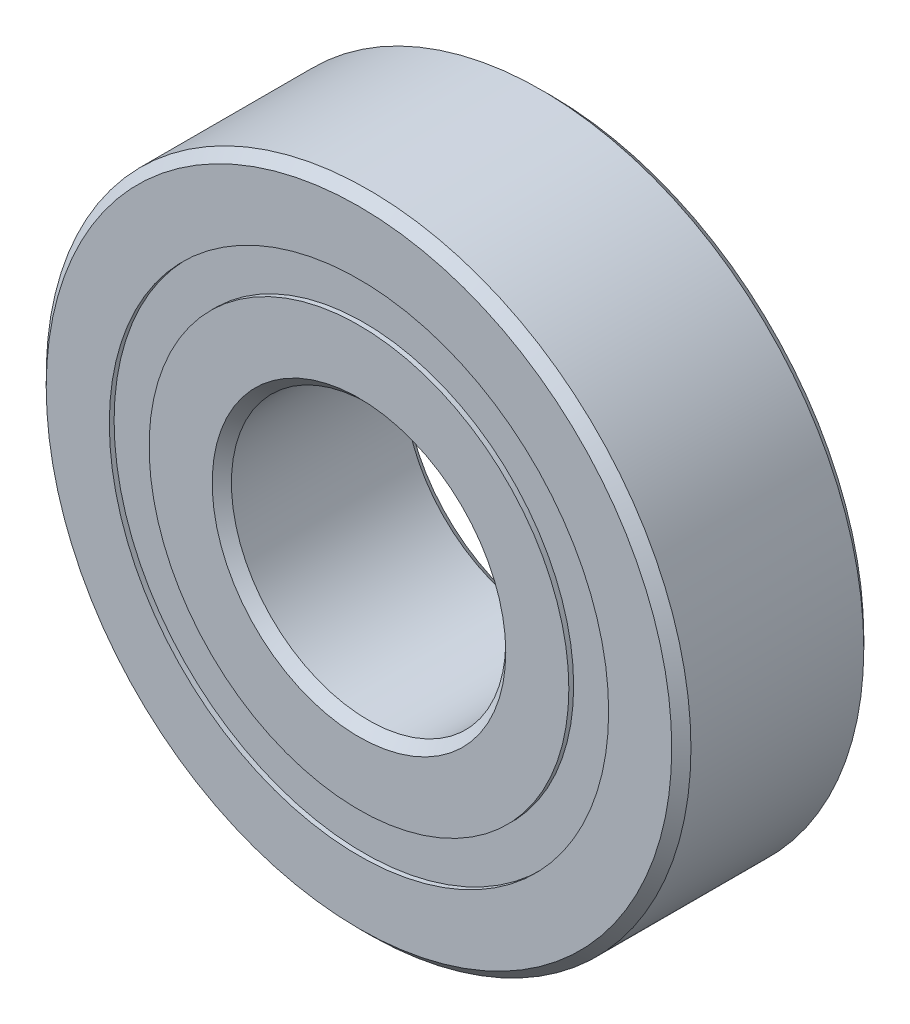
from build123d import *

# Parameters (mm, degrees)
CIRPATTERN1_COUNT = 12
SKETCH6_W         = 3.217347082
SKETCH6_H         = 2.901098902


with BuildPart() as part:
    # Sketch1 → Revolve1 (revolve)
    with BuildSketch(Plane(origin=(0, 0, 0), x_dir=(0, 0, -1), z_dir=(1, 0, 0)), mode=Mode.PRIVATE) as revolve1_sk:
        with BuildLine():
            Line((6.3, 23.5), (-6.3, 23.5))
            Line((-6.3, 23.5), (-7, 22.8))
            Line((-7, 22.8), (-7, 18.200549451))
            Line((-7, 18.200549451), (-3.111111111, 18.200549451))
            ThreePointArc((-3.111111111, 18.200549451), (0, 20.182652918), (3.111111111, 18.200549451))
            Line((3.111111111, 18.200549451), (7, 18.200549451))
            Line((7, 18.200549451), (7, 22.8))
            Line((7, 22.8), (6.3, 23.5))
        make_face()
    revolve(revolve1_sk.sketch.rotate(Axis((0, 0, 7), (0, 0, -1)), 90), axis=Axis((0, 0, 7), (0, 0, -1)))


with BuildPart() as body_2:
    # Sketch3 → Revolve3 (revolve)
    with BuildSketch(Plane(origin=(0, 0, 0), x_dir=(0, 0, -1), z_dir=(1, 0, 0)), mode=Mode.PRIVATE) as revolve3_sk:
        with BuildLine():
            Line((-7, 15.299450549), (-3.111111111, 15.299450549))
            ThreePointArc((-3.111111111, 15.299450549), (0, 13.317347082), (3.111111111, 15.299450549))
            Line((3.111111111, 15.299450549), (7, 15.299450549))
            Line((7, 15.299450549), (7, 10.7))
            Line((7, 10.7), (6.3, 10))
            Line((6.3, 10), (-6.3, 10))
            Line((-6.3, 10), (-7, 10.7))
            Line((-7, 10.7), (-7, 15.299450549))
        make_face()
    revolve(revolve3_sk.sketch.rotate(Axis((0, 0, 7), (0, 0, -1)), 90), axis=Axis((0, 0, 7), (0, 0, -1)))


with BuildPart() as body_3:
    # Sketch4 → Revolve4 (revolve)
    with BuildSketch(Plane(origin=(0, 0, 0), x_dir=(0, 0, -1), z_dir=(1, 0, 0))):
        with BuildLine():
            Line((-3.432652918, 16.75), (3.432652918, 16.75))
            ThreePointArc((3.432652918, 16.75), (0, 20.182652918), (-3.432652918, 16.75))
        make_face()
    revolve(axis=Axis((0, 16.75, 3.432652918), (0, 0, -1)))


with BuildPart() as cirpattern1_1:
    # CirPattern1: pattern copy
    add(body_3.part.rotate(Axis((0, 0, 0), (0, 0, 1)), 1 * 360 / CIRPATTERN1_COUNT))


with BuildPart() as cirpattern1_2:
    # CirPattern1: pattern copy
    add(body_3.part.rotate(Axis((0, 0, 0), (0, 0, 1)), 2 * 360 / CIRPATTERN1_COUNT))


with BuildPart() as cirpattern1_3:
    # CirPattern1: pattern copy
    add(body_3.part.rotate(Axis((0, 0, 0), (0, 0, 1)), 3 * 360 / CIRPATTERN1_COUNT))


with BuildPart() as cirpattern1_4:
    # CirPattern1: pattern copy
    add(body_3.part.rotate(Axis((0, 0, 0), (0, 0, 1)), 4 * 360 / CIRPATTERN1_COUNT))


with BuildPart() as cirpattern1_5:
    # CirPattern1: pattern copy
    add(body_3.part.rotate(Axis((0, 0, 0), (0, 0, 1)), 5 * 360 / CIRPATTERN1_COUNT))


with BuildPart() as cirpattern1_6:
    # CirPattern1: pattern copy
    add(body_3.part.rotate(Axis((0, 0, 0), (0, 0, 1)), 6 * 360 / CIRPATTERN1_COUNT))


with BuildPart() as cirpattern1_7:
    # CirPattern1: pattern copy
    add(body_3.part.rotate(Axis((0, 0, 0), (0, 0, 1)), 7 * 360 / CIRPATTERN1_COUNT))


with BuildPart() as cirpattern1_8:
    # CirPattern1: pattern copy
    add(body_3.part.rotate(Axis((0, 0, 0), (0, 0, 1)), 8 * 360 / CIRPATTERN1_COUNT))


with BuildPart() as cirpattern1_9:
    # CirPattern1: pattern copy
    add(body_3.part.rotate(Axis((0, 0, 0), (0, 0, 1)), 9 * 360 / CIRPATTERN1_COUNT))


with BuildPart() as cirpattern1_10:
    # CirPattern1: pattern copy
    add(body_3.part.rotate(Axis((0, 0, 0), (0, 0, 1)), 10 * 360 / CIRPATTERN1_COUNT))


with BuildPart() as cirpattern1_11:
    # CirPattern1: pattern copy
    add(body_3.part.rotate(Axis((0, 0, 0), (0, 0, 1)), 11 * 360 / CIRPATTERN1_COUNT))


with BuildPart() as body_15:
    # Sketch6 → Revolve5 (revolve)
    with BuildSketch(Plane(origin=(0, 0, 0), x_dir=(0, 0, -1), z_dir=(1, 0, 0)), mode=Mode.PRIVATE) as revolve5_sk:
        with Locations((-5.041326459, 16.75)):
            Rectangle(SKETCH6_W, SKETCH6_H)
        with Locations((5.041326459, 16.75)):
            Rectangle(SKETCH6_W, SKETCH6_H)
    revolve(revolve5_sk.sketch.rotate(Axis((0, 0, 7), (0, 0, -1)), 90), axis=Axis((0, 0, 7), (0, 0, -1)))


solid = Compound([part.part, body_2.part, body_3.part, cirpattern1_1.part, cirpattern1_2.part, cirpattern1_3.part, cirpattern1_4.part, cirpattern1_5.part, cirpattern1_6.part, cirpattern1_7.part, cirpattern1_8.part, cirpattern1_9.part, cirpattern1_10.part, cirpattern1_11.part, body_15.part])
